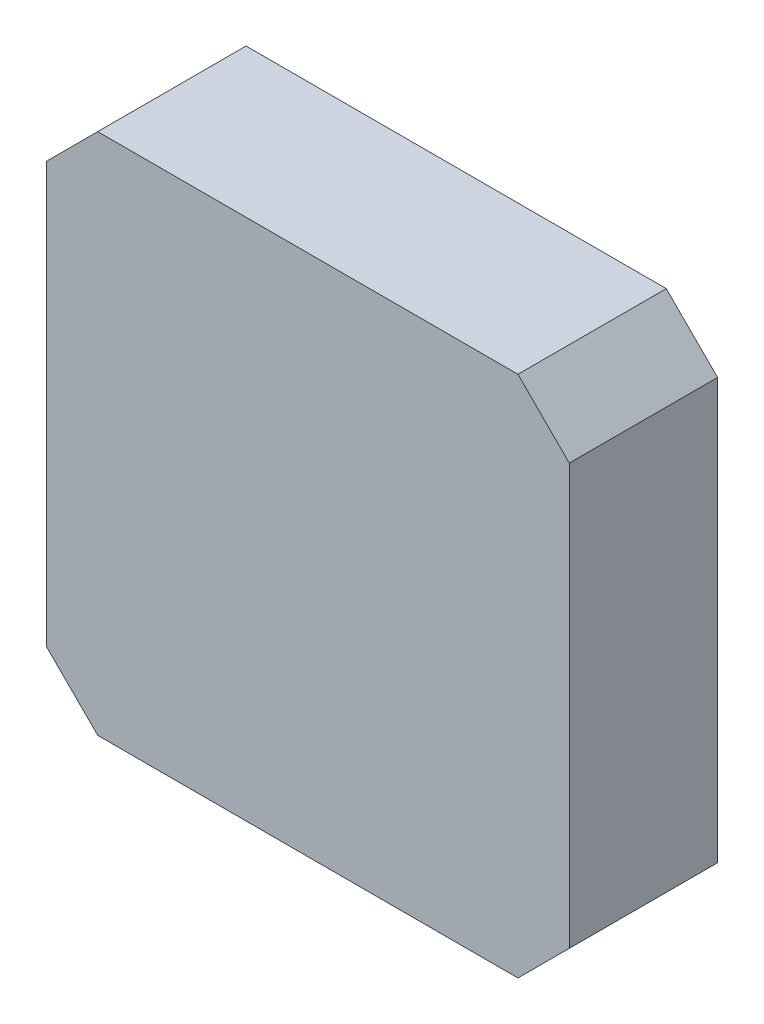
ISO-10303-21;
HEADER;
FILE_DESCRIPTION(('STEP AP214'),'2;1');
FILE_NAME('part.step','',(''),(''),'','','');
FILE_SCHEMA(('AUTOMOTIVE_DESIGN { 1 0 10303 214 1 1 1 1 }'));
ENDSEC;
DATA;
#1=APPLICATION_CONTEXT('core data for automotive mechanical design processes');
#2=APPLICATION_PROTOCOL_DEFINITION('international standard','automotive_design',2000,#1);
#3=PRODUCT_CONTEXT('',#1,'mechanical');
#4=PRODUCT('Part','Part','',(#3));
#5=PRODUCT_RELATED_PRODUCT_CATEGORY('part','',(#4));
#6=PRODUCT_DEFINITION_FORMATION('','',#4);
#7=PRODUCT_DEFINITION_CONTEXT('part definition',#1,'design');
#8=PRODUCT_DEFINITION('design','',#6,#7);
#9=PRODUCT_DEFINITION_SHAPE('','',#8);
#10=(LENGTH_UNIT() NAMED_UNIT(*) SI_UNIT(.MILLI.,.METRE.));
#11=(NAMED_UNIT(*) PLANE_ANGLE_UNIT() SI_UNIT($,.RADIAN.));
#12=(NAMED_UNIT(*) SI_UNIT($,.STERADIAN.) SOLID_ANGLE_UNIT());
#13=UNCERTAINTY_MEASURE_WITH_UNIT(LENGTH_MEASURE(1.E-05),#10,'distance_accuracy_value','');
#14=(GEOMETRIC_REPRESENTATION_CONTEXT(3) GLOBAL_UNCERTAINTY_ASSIGNED_CONTEXT((#13)) GLOBAL_UNIT_ASSIGNED_CONTEXT((#10,
#11,#12)) REPRESENTATION_CONTEXT('',''));
#15=CARTESIAN_POINT('',(0.,0.,0.));
#16=DIRECTION('',(0.,0.,1.));
#17=DIRECTION('',(1.,0.,0.));
#18=AXIS2_PLACEMENT_3D('',#15,#16,#17);
#19=CARTESIAN_POINT('',(21.1500000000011,-16.9999999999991,12.));
#20=DIRECTION('',(-1.,0.,0.));
#21=DIRECTION('',(0.,-1.,0.));
#22=AXIS2_PLACEMENT_3D('',#19,#20,#21);
#23=PLANE('',#22);
#24=DIRECTION('',(0.,1.,0.));
#25=VECTOR('',#24,1.);
#26=CARTESIAN_POINT('',(21.1500000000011,-16.9999999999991,0.));
#27=LINE('',#26,#25);
#28=CARTESIAN_POINT('',(21.1500000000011,-16.9999999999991,0.));
#29=VERTEX_POINT('',#28);
#30=CARTESIAN_POINT('',(21.1499999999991,17.0000000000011,0.));
#31=VERTEX_POINT('',#30);
#32=EDGE_CURVE('E135',#29,#31,#27,.T.);
#33=ORIENTED_EDGE('',*,*,#32,.T.);
#34=DIRECTION('',(0.,0.,-1.));
#35=VECTOR('',#34,1.);
#36=CARTESIAN_POINT('',(21.1499999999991,17.0000000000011,12.));
#37=LINE('',#36,#35);
#38=CARTESIAN_POINT('',(21.1499999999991,17.0000000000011,12.));
#39=VERTEX_POINT('',#38);
#40=EDGE_CURVE('E162',#39,#31,#37,.T.);
#41=ORIENTED_EDGE('',*,*,#40,.F.);
#42=DIRECTION('',(0.,1.,0.));
#43=VECTOR('',#42,1.);
#44=CARTESIAN_POINT('',(21.1500000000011,-16.9999999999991,12.));
#45=LINE('',#44,#43);
#46=CARTESIAN_POINT('',(21.1500000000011,-16.9999999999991,12.));
#47=VERTEX_POINT('',#46);
#48=EDGE_CURVE('E149',#47,#39,#45,.T.);
#49=ORIENTED_EDGE('',*,*,#48,.F.);
#50=DIRECTION('',(0.,0.,-1.));
#51=VECTOR('',#50,1.);
#52=CARTESIAN_POINT('',(21.1500000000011,-16.9999999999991,12.));
#53=LINE('',#52,#51);
#54=EDGE_CURVE('E131',#47,#29,#53,.T.);
#55=ORIENTED_EDGE('',*,*,#54,.T.);
#56=EDGE_LOOP('',(#33,#41,#49,#55));
#57=FACE_BOUND('',#56,.T.);
#58=ADVANCED_FACE('F37',(#57),#23,.F.);
#59=CARTESIAN_POINT('',(16.999999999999,21.1500000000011,12.));
#60=DIRECTION('',(-0.707106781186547,-0.707106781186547,0.));
#61=DIRECTION('',(0.707106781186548,-0.707106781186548,0.));
#62=AXIS2_PLACEMENT_3D('',#59,#60,#61);
#63=PLANE('',#62);
#64=DIRECTION('',(-0.707106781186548,0.707106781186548,0.));
#65=VECTOR('',#64,1.);
#66=CARTESIAN_POINT('',(16.999999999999,21.1500000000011,0.));
#67=LINE('',#66,#65);
#68=CARTESIAN_POINT('',(16.999999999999,21.1500000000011,0.));
#69=VERTEX_POINT('',#68);
#70=EDGE_CURVE('E138',#31,#69,#67,.T.);
#71=ORIENTED_EDGE('',*,*,#70,.T.);
#72=DIRECTION('',(0.,0.,-1.));
#73=VECTOR('',#72,1.);
#74=CARTESIAN_POINT('',(16.999999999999,21.1500000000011,12.));
#75=LINE('',#74,#73);
#76=CARTESIAN_POINT('',(16.999999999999,21.1500000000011,12.));
#77=VERTEX_POINT('',#76);
#78=EDGE_CURVE('E159',#77,#69,#75,.T.);
#79=ORIENTED_EDGE('',*,*,#78,.F.);
#80=DIRECTION('',(-0.707106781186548,0.707106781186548,0.));
#81=VECTOR('',#80,1.);
#82=CARTESIAN_POINT('',(16.999999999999,21.1500000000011,12.));
#83=LINE('',#82,#81);
#84=EDGE_CURVE('E98',#39,#77,#83,.T.);
#85=ORIENTED_EDGE('',*,*,#84,.F.);
#86=ORIENTED_EDGE('',*,*,#40,.T.);
#87=EDGE_LOOP('',(#71,#79,#85,#86));
#88=FACE_BOUND('',#87,.T.);
#89=ADVANCED_FACE('F217',(#88),#63,.F.);
#90=CARTESIAN_POINT('',(16.999999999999,21.1500000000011,12.));
#91=DIRECTION('',(0.,-1.,0.));
#92=DIRECTION('',(1.,0.,0.));
#93=AXIS2_PLACEMENT_3D('',#90,#91,#92);
#94=PLANE('',#93);
#95=DIRECTION('',(-1.,0.,0.));
#96=VECTOR('',#95,1.);
#97=CARTESIAN_POINT('',(16.999999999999,21.1500000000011,0.));
#98=LINE('',#97,#96);
#99=CARTESIAN_POINT('',(-17.0000000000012,21.1499999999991,0.));
#100=VERTEX_POINT('',#99);
#101=EDGE_CURVE('E140',#69,#100,#98,.T.);
#102=ORIENTED_EDGE('',*,*,#101,.T.);
#103=DIRECTION('',(0.,0.,-1.));
#104=VECTOR('',#103,1.);
#105=CARTESIAN_POINT('',(-17.0000000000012,21.1499999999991,12.));
#106=LINE('',#105,#104);
#107=CARTESIAN_POINT('',(-17.0000000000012,21.1499999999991,12.));
#108=VERTEX_POINT('',#107);
#109=EDGE_CURVE('E156',#108,#100,#106,.T.);
#110=ORIENTED_EDGE('',*,*,#109,.F.);
#111=DIRECTION('',(-1.,0.,0.));
#112=VECTOR('',#111,1.);
#113=CARTESIAN_POINT('',(16.999999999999,21.1500000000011,12.));
#114=LINE('',#113,#112);
#115=EDGE_CURVE('E316',#77,#108,#114,.T.);
#116=ORIENTED_EDGE('',*,*,#115,.F.);
#117=ORIENTED_EDGE('',*,*,#78,.T.);
#118=EDGE_LOOP('',(#102,#110,#116,#117));
#119=FACE_BOUND('',#118,.T.);
#120=ADVANCED_FACE('F223',(#119),#94,.F.);
#121=CARTESIAN_POINT('',(-21.1500000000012,16.9999999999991,12.));
#122=DIRECTION('',(0.707106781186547,-0.707106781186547,0.));
#123=DIRECTION('',(0.707106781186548,0.707106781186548,0.));
#124=AXIS2_PLACEMENT_3D('',#121,#122,#123);
#125=PLANE('',#124);
#126=DIRECTION('',(-0.707106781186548,-0.707106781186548,0.));
#127=VECTOR('',#126,1.);
#128=CARTESIAN_POINT('',(-21.1500000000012,16.9999999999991,0.));
#129=LINE('',#128,#127);
#130=CARTESIAN_POINT('',(-21.1500000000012,16.9999999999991,0.));
#131=VERTEX_POINT('',#130);
#132=EDGE_CURVE('E142',#100,#131,#129,.T.);
#133=ORIENTED_EDGE('',*,*,#132,.T.);
#134=DIRECTION('',(0.,0.,-1.));
#135=VECTOR('',#134,1.);
#136=CARTESIAN_POINT('',(-21.1500000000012,16.9999999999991,12.));
#137=LINE('',#136,#135);
#138=CARTESIAN_POINT('',(-21.1500000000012,16.9999999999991,12.));
#139=VERTEX_POINT('',#138);
#140=EDGE_CURVE('E153',#139,#131,#137,.T.);
#141=ORIENTED_EDGE('',*,*,#140,.F.);
#142=DIRECTION('',(-0.707106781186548,-0.707106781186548,0.));
#143=VECTOR('',#142,1.);
#144=CARTESIAN_POINT('',(-21.1500000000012,16.9999999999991,12.));
#145=LINE('',#144,#143);
#146=EDGE_CURVE('E313',#108,#139,#145,.T.);
#147=ORIENTED_EDGE('',*,*,#146,.F.);
#148=ORIENTED_EDGE('',*,*,#109,.T.);
#149=EDGE_LOOP('',(#133,#141,#147,#148));
#150=FACE_BOUND('',#149,.T.);
#151=ADVANCED_FACE('F298',(#150),#125,.F.);
#152=CARTESIAN_POINT('',(-21.1500000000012,16.9999999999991,12.));
#153=DIRECTION('',(1.,0.,0.));
#154=DIRECTION('',(0.,1.,0.));
#155=AXIS2_PLACEMENT_3D('',#152,#153,#154);
#156=PLANE('',#155);
#157=DIRECTION('',(0.,-1.,0.));
#158=VECTOR('',#157,1.);
#159=CARTESIAN_POINT('',(-21.1500000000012,16.9999999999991,0.));
#160=LINE('',#159,#158);
#161=CARTESIAN_POINT('',(-21.1499999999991,-17.0000000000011,0.));
#162=VERTEX_POINT('',#161);
#163=EDGE_CURVE('E144',#131,#162,#160,.T.);
#164=ORIENTED_EDGE('',*,*,#163,.T.);
#165=DIRECTION('',(0.,0.,-1.));
#166=VECTOR('',#165,1.);
#167=CARTESIAN_POINT('',(-21.1499999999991,-17.0000000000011,12.));
#168=LINE('',#167,#166);
#169=CARTESIAN_POINT('',(-21.1499999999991,-17.0000000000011,12.));
#170=VERTEX_POINT('',#169);
#171=EDGE_CURVE('E126',#170,#162,#168,.T.);
#172=ORIENTED_EDGE('',*,*,#171,.F.);
#173=DIRECTION('',(0.,-1.,0.));
#174=VECTOR('',#173,1.);
#175=CARTESIAN_POINT('',(-21.1500000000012,16.9999999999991,12.));
#176=LINE('',#175,#174);
#177=EDGE_CURVE('E117',#139,#170,#176,.T.);
#178=ORIENTED_EDGE('',*,*,#177,.F.);
#179=ORIENTED_EDGE('',*,*,#140,.T.);
#180=EDGE_LOOP('',(#164,#172,#178,#179));
#181=FACE_BOUND('',#180,.T.);
#182=ADVANCED_FACE('F295',(#181),#156,.F.);
#183=CARTESIAN_POINT('',(-16.9999999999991,-21.1500000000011,12.));
#184=DIRECTION('',(0.707106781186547,0.707106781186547,0.));
#185=DIRECTION('',(-0.707106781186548,0.707106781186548,0.));
#186=AXIS2_PLACEMENT_3D('',#183,#184,#185);
#187=PLANE('',#186);
#188=DIRECTION('',(0.707106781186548,-0.707106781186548,0.));
#189=VECTOR('',#188,1.);
#190=CARTESIAN_POINT('',(-16.9999999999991,-21.1500000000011,0.));
#191=LINE('',#190,#189);
#192=CARTESIAN_POINT('',(-16.9999999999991,-21.1500000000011,0.));
#193=VERTEX_POINT('',#192);
#194=EDGE_CURVE('E125',#162,#193,#191,.T.);
#195=ORIENTED_EDGE('',*,*,#194,.T.);
#196=DIRECTION('',(0.,0.,-1.));
#197=VECTOR('',#196,1.);
#198=CARTESIAN_POINT('',(-16.9999999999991,-21.1500000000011,12.));
#199=LINE('',#198,#197);
#200=CARTESIAN_POINT('',(-16.9999999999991,-21.1500000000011,12.));
#201=VERTEX_POINT('',#200);
#202=EDGE_CURVE('E122',#201,#193,#199,.T.);
#203=ORIENTED_EDGE('',*,*,#202,.F.);
#204=DIRECTION('',(0.707106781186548,-0.707106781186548,0.));
#205=VECTOR('',#204,1.);
#206=CARTESIAN_POINT('',(-16.9999999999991,-21.1500000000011,12.));
#207=LINE('',#206,#205);
#208=EDGE_CURVE('E111',#170,#201,#207,.T.);
#209=ORIENTED_EDGE('',*,*,#208,.F.);
#210=ORIENTED_EDGE('',*,*,#171,.T.);
#211=EDGE_LOOP('',(#195,#203,#209,#210));
#212=FACE_BOUND('',#211,.T.);
#213=ADVANCED_FACE('F123',(#212),#187,.F.);
#214=CARTESIAN_POINT('',(-16.9999999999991,-21.1500000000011,12.));
#215=DIRECTION('',(0.,1.,0.));
#216=DIRECTION('',(-1.,0.,0.));
#217=AXIS2_PLACEMENT_3D('',#214,#215,#216);
#218=PLANE('',#217);
#219=DIRECTION('',(1.,0.,0.));
#220=VECTOR('',#219,1.);
#221=CARTESIAN_POINT('',(-16.9999999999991,-21.1500000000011,0.));
#222=LINE('',#221,#220);
#223=CARTESIAN_POINT('',(17.0000000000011,-21.1499999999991,0.));
#224=VERTEX_POINT('',#223);
#225=EDGE_CURVE('E83',#193,#224,#222,.T.);
#226=ORIENTED_EDGE('',*,*,#225,.T.);
#227=DIRECTION('',(0.,0.,-1.));
#228=VECTOR('',#227,1.);
#229=CARTESIAN_POINT('',(17.0000000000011,-21.1499999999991,12.));
#230=LINE('',#229,#228);
#231=CARTESIAN_POINT('',(17.0000000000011,-21.1499999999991,12.));
#232=VERTEX_POINT('',#231);
#233=EDGE_CURVE('E127',#232,#224,#230,.T.);
#234=ORIENTED_EDGE('',*,*,#233,.F.);
#235=DIRECTION('',(1.,0.,0.));
#236=VECTOR('',#235,1.);
#237=CARTESIAN_POINT('',(-16.9999999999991,-21.1500000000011,12.));
#238=LINE('',#237,#236);
#239=EDGE_CURVE('E115',#201,#232,#238,.T.);
#240=ORIENTED_EDGE('',*,*,#239,.F.);
#241=ORIENTED_EDGE('',*,*,#202,.T.);
#242=EDGE_LOOP('',(#226,#234,#240,#241));
#243=FACE_BOUND('',#242,.T.);
#244=ADVANCED_FACE('F129',(#243),#218,.F.);
#245=CARTESIAN_POINT('',(21.1500000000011,-16.9999999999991,12.));
#246=DIRECTION('',(-0.707106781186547,0.707106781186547,0.));
#247=DIRECTION('',(-0.707106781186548,-0.707106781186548,0.));
#248=AXIS2_PLACEMENT_3D('',#245,#246,#247);
#249=PLANE('',#248);
#250=DIRECTION('',(0.707106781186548,0.707106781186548,0.));
#251=VECTOR('',#250,1.);
#252=CARTESIAN_POINT('',(21.1500000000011,-16.9999999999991,0.));
#253=LINE('',#252,#251);
#254=EDGE_CURVE('E89',#224,#29,#253,.T.);
#255=ORIENTED_EDGE('',*,*,#254,.T.);
#256=ORIENTED_EDGE('',*,*,#54,.F.);
#257=DIRECTION('',(0.707106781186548,0.707106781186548,0.));
#258=VECTOR('',#257,1.);
#259=CARTESIAN_POINT('',(21.1500000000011,-16.9999999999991,12.));
#260=LINE('',#259,#258);
#261=EDGE_CURVE('E54',#232,#47,#260,.T.);
#262=ORIENTED_EDGE('',*,*,#261,.F.);
#263=ORIENTED_EDGE('',*,*,#233,.T.);
#264=EDGE_LOOP('',(#255,#256,#262,#263));
#265=FACE_BOUND('',#264,.T.);
#266=ADVANCED_FACE('F285',(#265),#249,.F.);
#267=CARTESIAN_POINT('',(0.,0.,12.));
#268=DIRECTION('',(0.,0.,1.));
#269=DIRECTION('',(1.,0.,0.));
#270=AXIS2_PLACEMENT_3D('',#267,#268,#269);
#271=PLANE('',#270);
#272=ORIENTED_EDGE('',*,*,#48,.T.);
#273=ORIENTED_EDGE('',*,*,#84,.T.);
#274=ORIENTED_EDGE('',*,*,#115,.T.);
#275=ORIENTED_EDGE('',*,*,#146,.T.);
#276=ORIENTED_EDGE('',*,*,#177,.T.);
#277=ORIENTED_EDGE('',*,*,#208,.T.);
#278=ORIENTED_EDGE('',*,*,#239,.T.);
#279=ORIENTED_EDGE('',*,*,#261,.T.);
#280=EDGE_LOOP('',(#272,#273,#274,#275,#276,#277,#278,#279));
#281=FACE_BOUND('',#280,.T.);
#282=ADVANCED_FACE('F113',(#281),#271,.T.);
#283=CARTESIAN_POINT('',(0.,0.,0.));
#284=DIRECTION('',(0.,0.,1.));
#285=DIRECTION('',(1.,0.,0.));
#286=AXIS2_PLACEMENT_3D('',#283,#284,#285);
#287=PLANE('',#286);
#288=CARTESIAN_POINT('',(15.5,-15.5,0.));
#289=DIRECTION('',(0.,0.,1.));
#290=DIRECTION('',(1.,0.,0.));
#291=AXIS2_PLACEMENT_3D('',#288,#289,#290);
#292=CIRCLE('',#291,1.5);
#293=CARTESIAN_POINT('',(17.,-15.5,0.));
#294=VERTEX_POINT('',#293);
#295=EDGE_CURVE('E176',#294,#294,#292,.F.);
#296=ORIENTED_EDGE('',*,*,#295,.F.);
#297=EDGE_LOOP('',(#296));
#298=FACE_BOUND('',#297,.T.);
#299=CARTESIAN_POINT('',(15.5,15.5,0.));
#300=DIRECTION('',(0.,0.,1.));
#301=DIRECTION('',(1.,0.,0.));
#302=AXIS2_PLACEMENT_3D('',#299,#300,#301);
#303=CIRCLE('',#302,1.5);
#304=CARTESIAN_POINT('',(17.,15.5,0.));
#305=VERTEX_POINT('',#304);
#306=EDGE_CURVE('E173',#305,#305,#303,.F.);
#307=ORIENTED_EDGE('',*,*,#306,.F.);
#308=EDGE_LOOP('',(#307));
#309=FACE_BOUND('',#308,.T.);
#310=CARTESIAN_POINT('',(0.,0.,0.));
#311=DIRECTION('',(0.,0.,1.));
#312=DIRECTION('',(1.,0.,0.));
#313=AXIS2_PLACEMENT_3D('',#310,#311,#312);
#314=CIRCLE('',#313,1.5);
#315=CARTESIAN_POINT('',(1.5,0.,0.));
#316=VERTEX_POINT('',#315);
#317=EDGE_CURVE('E170',#316,#316,#314,.F.);
#318=ORIENTED_EDGE('',*,*,#317,.F.);
#319=EDGE_LOOP('',(#318));
#320=FACE_BOUND('',#319,.T.);
#321=CARTESIAN_POINT('',(-15.5,-15.5,0.));
#322=DIRECTION('',(0.,0.,1.));
#323=DIRECTION('',(1.,0.,0.));
#324=AXIS2_PLACEMENT_3D('',#321,#322,#323);
#325=CIRCLE('',#324,1.5);
#326=CARTESIAN_POINT('',(-14.,-15.5,0.));
#327=VERTEX_POINT('',#326);
#328=EDGE_CURVE('E167',#327,#327,#325,.F.);
#329=ORIENTED_EDGE('',*,*,#328,.F.);
#330=EDGE_LOOP('',(#329));
#331=FACE_BOUND('',#330,.T.);
#332=CARTESIAN_POINT('',(-15.5,15.5,0.));
#333=DIRECTION('',(0.,0.,1.));
#334=DIRECTION('',(1.,0.,0.));
#335=AXIS2_PLACEMENT_3D('',#332,#333,#334);
#336=CIRCLE('',#335,1.5);
#337=CARTESIAN_POINT('',(-14.,15.5,0.));
#338=VERTEX_POINT('',#337);
#339=EDGE_CURVE('E164',#338,#338,#336,.F.);
#340=ORIENTED_EDGE('',*,*,#339,.F.);
#341=EDGE_LOOP('',(#340));
#342=FACE_BOUND('',#341,.T.);
#343=ORIENTED_EDGE('',*,*,#32,.F.);
#344=ORIENTED_EDGE('',*,*,#254,.F.);
#345=ORIENTED_EDGE('',*,*,#225,.F.);
#346=ORIENTED_EDGE('',*,*,#194,.F.);
#347=ORIENTED_EDGE('',*,*,#163,.F.);
#348=ORIENTED_EDGE('',*,*,#132,.F.);
#349=ORIENTED_EDGE('',*,*,#101,.F.);
#350=ORIENTED_EDGE('',*,*,#70,.F.);
#351=EDGE_LOOP('',(#343,#344,#345,#346,#347,#348,#349,#350));
#352=FACE_BOUND('',#351,.T.);
#353=ADVANCED_FACE('F281',(#298,#309,#320,#331,#342,#352),#287,.F.);
#354=CARTESIAN_POINT('',(-15.5,15.5,-3.));
#355=DIRECTION('',(0.,0.,1.));
#356=DIRECTION('',(1.,0.,0.));
#357=AXIS2_PLACEMENT_3D('',#354,#355,#356);
#358=CYLINDRICAL_SURFACE('',#357,1.5);
#359=CARTESIAN_POINT('',(-15.5,15.5,-2.));
#360=DIRECTION('',(0.,0.,-1.));
#361=DIRECTION('',(-1.,0.,0.));
#362=AXIS2_PLACEMENT_3D('',#359,#360,#361);
#363=CIRCLE('',#362,1.5);
#364=CARTESIAN_POINT('',(-17.,15.5,-2.));
#365=VERTEX_POINT('',#364);
#366=EDGE_CURVE('E188',#365,#365,#363,.F.);
#367=ORIENTED_EDGE('',*,*,#366,.T.);
#368=EDGE_LOOP('',(#367));
#369=FACE_BOUND('',#368,.T.);
#370=ORIENTED_EDGE('',*,*,#339,.T.);
#371=EDGE_LOOP('',(#370));
#372=FACE_BOUND('',#371,.T.);
#373=ADVANCED_FACE('F277',(#369,#372),#358,.T.);
#374=CARTESIAN_POINT('',(-15.5,15.5,-3.));
#375=DIRECTION('',(0.,0.,-1.));
#376=DIRECTION('',(-1.,0.,0.));
#377=AXIS2_PLACEMENT_3D('',#374,#375,#376);
#378=PLANE('',#377);
#379=CARTESIAN_POINT('',(-15.5,15.5,-3.));
#380=DIRECTION('',(0.,0.,-1.));
#381=DIRECTION('',(-1.,0.,0.));
#382=AXIS2_PLACEMENT_3D('',#379,#380,#381);
#383=CIRCLE('',#382,0.499999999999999);
#384=CARTESIAN_POINT('',(-16.,15.5,-3.));
#385=VERTEX_POINT('',#384);
#386=EDGE_CURVE('E185',#385,#385,#383,.T.);
#387=ORIENTED_EDGE('',*,*,#386,.T.);
#388=EDGE_LOOP('',(#387));
#389=FACE_BOUND('',#388,.T.);
#390=ADVANCED_FACE('F270',(#389),#378,.T.);
#391=CARTESIAN_POINT('',(-15.5,-15.5,-3.));
#392=DIRECTION('',(0.,0.,1.));
#393=DIRECTION('',(1.,0.,0.));
#394=AXIS2_PLACEMENT_3D('',#391,#392,#393);
#395=CYLINDRICAL_SURFACE('',#394,1.5);
#396=CARTESIAN_POINT('',(-15.5,-15.5,-2.));
#397=DIRECTION('',(0.,0.,-1.));
#398=DIRECTION('',(-1.,0.,0.));
#399=AXIS2_PLACEMENT_3D('',#396,#397,#398);
#400=CIRCLE('',#399,1.5);
#401=CARTESIAN_POINT('',(-17.,-15.5,-2.));
#402=VERTEX_POINT('',#401);
#403=EDGE_CURVE('E182',#402,#402,#400,.F.);
#404=ORIENTED_EDGE('',*,*,#403,.T.);
#405=EDGE_LOOP('',(#404));
#406=FACE_BOUND('',#405,.T.);
#407=ORIENTED_EDGE('',*,*,#328,.T.);
#408=EDGE_LOOP('',(#407));
#409=FACE_BOUND('',#408,.T.);
#410=ADVANCED_FACE('F267',(#406,#409),#395,.T.);
#411=CARTESIAN_POINT('',(-15.5,-15.5,-3.));
#412=DIRECTION('',(0.,0.,-1.));
#413=DIRECTION('',(-1.,0.,0.));
#414=AXIS2_PLACEMENT_3D('',#411,#412,#413);
#415=PLANE('',#414);
#416=CARTESIAN_POINT('',(-15.5,-15.5,-3.));
#417=DIRECTION('',(0.,0.,-1.));
#418=DIRECTION('',(-1.,0.,0.));
#419=AXIS2_PLACEMENT_3D('',#416,#417,#418);
#420=CIRCLE('',#419,0.499999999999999);
#421=CARTESIAN_POINT('',(-16.,-15.5,-3.));
#422=VERTEX_POINT('',#421);
#423=EDGE_CURVE('E179',#422,#422,#420,.T.);
#424=ORIENTED_EDGE('',*,*,#423,.T.);
#425=EDGE_LOOP('',(#424));
#426=FACE_BOUND('',#425,.T.);
#427=ADVANCED_FACE('F262',(#426),#415,.T.);
#428=CARTESIAN_POINT('',(0.,0.,-3.));
#429=DIRECTION('',(0.,0.,1.));
#430=DIRECTION('',(1.,0.,0.));
#431=AXIS2_PLACEMENT_3D('',#428,#429,#430);
#432=CYLINDRICAL_SURFACE('',#431,1.5);
#433=CARTESIAN_POINT('',(0.,0.,-2.));
#434=DIRECTION('',(0.,0.,-1.));
#435=DIRECTION('',(-1.,0.,0.));
#436=AXIS2_PLACEMENT_3D('',#433,#434,#435);
#437=CIRCLE('',#436,1.5);
#438=CARTESIAN_POINT('',(-1.5,0.,-2.));
#439=VERTEX_POINT('',#438);
#440=EDGE_CURVE('E200',#439,#439,#437,.F.);
#441=ORIENTED_EDGE('',*,*,#440,.T.);
#442=EDGE_LOOP('',(#441));
#443=FACE_BOUND('',#442,.T.);
#444=ORIENTED_EDGE('',*,*,#317,.T.);
#445=EDGE_LOOP('',(#444));
#446=FACE_BOUND('',#445,.T.);
#447=ADVANCED_FACE('F259',(#443,#446),#432,.T.);
#448=CARTESIAN_POINT('',(0.,0.,-3.));
#449=DIRECTION('',(0.,0.,-1.));
#450=DIRECTION('',(-1.,0.,0.));
#451=AXIS2_PLACEMENT_3D('',#448,#449,#450);
#452=PLANE('',#451);
#453=CARTESIAN_POINT('',(0.,0.,-3.));
#454=DIRECTION('',(0.,0.,-1.));
#455=DIRECTION('',(-1.,0.,0.));
#456=AXIS2_PLACEMENT_3D('',#453,#454,#455);
#457=CIRCLE('',#456,0.5);
#458=CARTESIAN_POINT('',(-0.499999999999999,0.,-3.));
#459=VERTEX_POINT('',#458);
#460=EDGE_CURVE('E197',#459,#459,#457,.T.);
#461=ORIENTED_EDGE('',*,*,#460,.T.);
#462=EDGE_LOOP('',(#461));
#463=FACE_BOUND('',#462,.T.);
#464=ADVANCED_FACE('F254',(#463),#452,.T.);
#465=CARTESIAN_POINT('',(15.5,15.5,-3.));
#466=DIRECTION('',(0.,0.,1.));
#467=DIRECTION('',(1.,0.,0.));
#468=AXIS2_PLACEMENT_3D('',#465,#466,#467);
#469=CYLINDRICAL_SURFACE('',#468,1.5);
#470=CARTESIAN_POINT('',(15.5,15.5,-2.));
#471=DIRECTION('',(0.,0.,-1.));
#472=DIRECTION('',(-1.,0.,0.));
#473=AXIS2_PLACEMENT_3D('',#470,#471,#472);
#474=CIRCLE('',#473,1.5);
#475=CARTESIAN_POINT('',(14.,15.5,-2.));
#476=VERTEX_POINT('',#475);
#477=EDGE_CURVE('E194',#476,#476,#474,.F.);
#478=ORIENTED_EDGE('',*,*,#477,.T.);
#479=EDGE_LOOP('',(#478));
#480=FACE_BOUND('',#479,.T.);
#481=ORIENTED_EDGE('',*,*,#306,.T.);
#482=EDGE_LOOP('',(#481));
#483=FACE_BOUND('',#482,.T.);
#484=ADVANCED_FACE('F246',(#480,#483),#469,.T.);
#485=CARTESIAN_POINT('',(15.5,15.5,-3.));
#486=DIRECTION('',(0.,0.,-1.));
#487=DIRECTION('',(-1.,0.,0.));
#488=AXIS2_PLACEMENT_3D('',#485,#486,#487);
#489=PLANE('',#488);
#490=CARTESIAN_POINT('',(15.5,15.5,-3.));
#491=DIRECTION('',(0.,0.,-1.));
#492=DIRECTION('',(-1.,0.,0.));
#493=AXIS2_PLACEMENT_3D('',#490,#491,#492);
#494=CIRCLE('',#493,0.499999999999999);
#495=CARTESIAN_POINT('',(15.,15.5,-3.));
#496=VERTEX_POINT('',#495);
#497=EDGE_CURVE('E191',#496,#496,#494,.T.);
#498=ORIENTED_EDGE('',*,*,#497,.T.);
#499=EDGE_LOOP('',(#498));
#500=FACE_BOUND('',#499,.T.);
#501=ADVANCED_FACE('F243',(#500),#489,.T.);
#502=CARTESIAN_POINT('',(15.5,-15.5,-3.));
#503=DIRECTION('',(0.,0.,1.));
#504=DIRECTION('',(1.,0.,0.));
#505=AXIS2_PLACEMENT_3D('',#502,#503,#504);
#506=CYLINDRICAL_SURFACE('',#505,1.5);
#507=CARTESIAN_POINT('',(15.5,-15.5,-2.));
#508=DIRECTION('',(0.,0.,-1.));
#509=DIRECTION('',(-1.,0.,0.));
#510=AXIS2_PLACEMENT_3D('',#507,#508,#509);
#511=CIRCLE('',#510,1.5);
#512=CARTESIAN_POINT('',(14.,-15.5,-2.));
#513=VERTEX_POINT('',#512);
#514=EDGE_CURVE('E11',#513,#513,#511,.F.);
#515=ORIENTED_EDGE('',*,*,#514,.T.);
#516=EDGE_LOOP('',(#515));
#517=FACE_BOUND('',#516,.T.);
#518=ORIENTED_EDGE('',*,*,#295,.T.);
#519=EDGE_LOOP('',(#518));
#520=FACE_BOUND('',#519,.T.);
#521=ADVANCED_FACE('F245',(#517,#520),#506,.T.);
#522=CARTESIAN_POINT('',(15.5,-15.5,-3.));
#523=DIRECTION('',(0.,0.,-1.));
#524=DIRECTION('',(-1.,0.,0.));
#525=AXIS2_PLACEMENT_3D('',#522,#523,#524);
#526=PLANE('',#525);
#527=CARTESIAN_POINT('',(15.5,-15.5,-3.));
#528=DIRECTION('',(0.,0.,-1.));
#529=DIRECTION('',(-1.,0.,0.));
#530=AXIS2_PLACEMENT_3D('',#527,#528,#529);
#531=CIRCLE('',#530,0.499999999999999);
#532=CARTESIAN_POINT('',(15.,-15.5,-3.));
#533=VERTEX_POINT('',#532);
#534=EDGE_CURVE('E46',#533,#533,#531,.T.);
#535=ORIENTED_EDGE('',*,*,#534,.T.);
#536=EDGE_LOOP('',(#535));
#537=FACE_BOUND('',#536,.T.);
#538=ADVANCED_FACE('F205',(#537),#526,.T.);
#539=CARTESIAN_POINT('',(-15.5,-15.5,-2.));
#540=DIRECTION('',(0.,0.,-1.));
#541=DIRECTION('',(-1.,0.,0.));
#542=AXIS2_PLACEMENT_3D('',#539,#540,#541);
#543=DEGENERATE_TOROIDAL_SURFACE('',#542,0.499999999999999,1.,.T.);
#544=ORIENTED_EDGE('',*,*,#403,.F.);
#545=EDGE_LOOP('',(#544));
#546=FACE_BOUND('',#545,.T.);
#547=ORIENTED_EDGE('',*,*,#423,.F.);
#548=EDGE_LOOP('',(#547));
#549=FACE_BOUND('',#548,.T.);
#550=ADVANCED_FACE('F227',(#546,#549),#543,.T.);
#551=CARTESIAN_POINT('',(-15.5,15.5,-2.));
#552=DIRECTION('',(0.,0.,-1.));
#553=DIRECTION('',(-1.,0.,0.));
#554=AXIS2_PLACEMENT_3D('',#551,#552,#553);
#555=DEGENERATE_TOROIDAL_SURFACE('',#554,0.499999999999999,1.,.T.);
#556=ORIENTED_EDGE('',*,*,#366,.F.);
#557=EDGE_LOOP('',(#556));
#558=FACE_BOUND('',#557,.T.);
#559=ORIENTED_EDGE('',*,*,#386,.F.);
#560=EDGE_LOOP('',(#559));
#561=FACE_BOUND('',#560,.T.);
#562=ADVANCED_FACE('F230',(#558,#561),#555,.T.);
#563=CARTESIAN_POINT('',(15.5,15.5,-2.));
#564=DIRECTION('',(0.,0.,-1.));
#565=DIRECTION('',(-1.,0.,0.));
#566=AXIS2_PLACEMENT_3D('',#563,#564,#565);
#567=DEGENERATE_TOROIDAL_SURFACE('',#566,0.499999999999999,1.,.T.);
#568=ORIENTED_EDGE('',*,*,#477,.F.);
#569=EDGE_LOOP('',(#568));
#570=FACE_BOUND('',#569,.T.);
#571=ORIENTED_EDGE('',*,*,#497,.F.);
#572=EDGE_LOOP('',(#571));
#573=FACE_BOUND('',#572,.T.);
#574=ADVANCED_FACE('F213',(#570,#573),#567,.T.);
#575=CARTESIAN_POINT('',(0.,0.,-2.));
#576=DIRECTION('',(0.,0.,-1.));
#577=DIRECTION('',(-1.,0.,0.));
#578=AXIS2_PLACEMENT_3D('',#575,#576,#577);
#579=DEGENERATE_TOROIDAL_SURFACE('',#578,0.5,1.,.T.);
#580=ORIENTED_EDGE('',*,*,#440,.F.);
#581=EDGE_LOOP('',(#580));
#582=FACE_BOUND('',#581,.T.);
#583=ORIENTED_EDGE('',*,*,#460,.F.);
#584=EDGE_LOOP('',(#583));
#585=FACE_BOUND('',#584,.T.);
#586=ADVANCED_FACE('F208',(#582,#585),#579,.T.);
#587=CARTESIAN_POINT('',(15.5,-15.5,-2.));
#588=DIRECTION('',(0.,0.,-1.));
#589=DIRECTION('',(-1.,0.,0.));
#590=AXIS2_PLACEMENT_3D('',#587,#588,#589);
#591=DEGENERATE_TOROIDAL_SURFACE('',#590,0.499999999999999,1.,.T.);
#592=ORIENTED_EDGE('',*,*,#514,.F.);
#593=EDGE_LOOP('',(#592));
#594=FACE_BOUND('',#593,.T.);
#595=ORIENTED_EDGE('',*,*,#534,.F.);
#596=EDGE_LOOP('',(#595));
#597=FACE_BOUND('',#596,.T.);
#598=ADVANCED_FACE('F39',(#594,#597),#591,.T.);
#599=CLOSED_SHELL('',(#58,#89,#120,#151,#182,#213,#244,#266,#282,#353,#373,#390,#410,#427,#447,
#464,#484,#501,#521,#538,#550,#562,#574,#586,#598));
#600=MANIFOLD_SOLID_BREP('B2',#599);
#601=ADVANCED_BREP_SHAPE_REPRESENTATION('',(#18,#600),#14);
#602=SHAPE_DEFINITION_REPRESENTATION(#9,#601);
ENDSEC;
END-ISO-10303-21;
